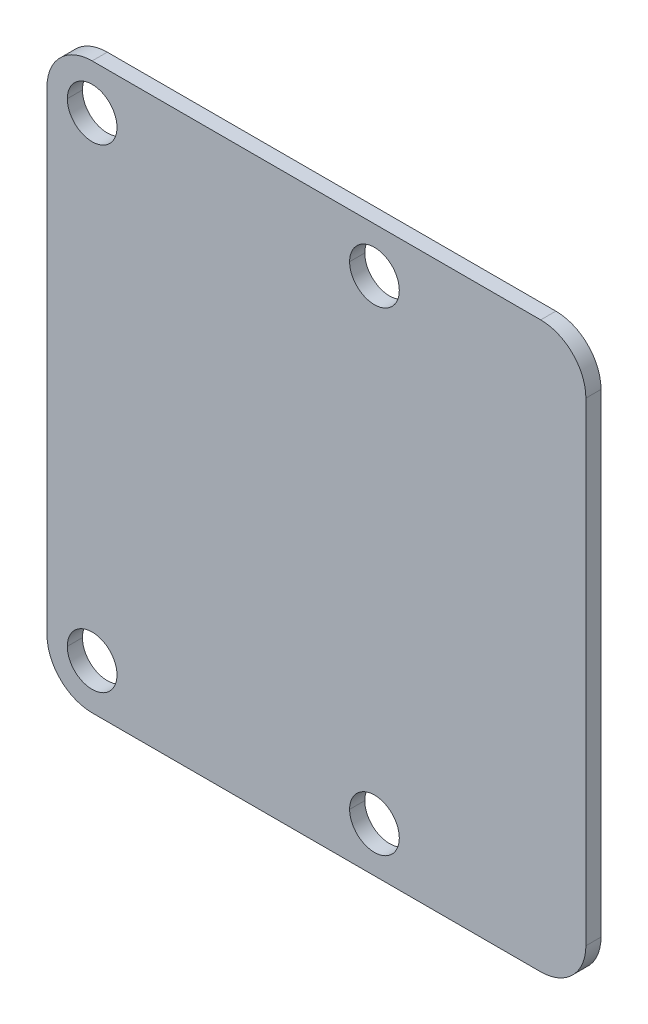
ISO-10303-21;
HEADER;
FILE_DESCRIPTION(('STEP AP214'),'2;1');
FILE_NAME('part.step','',(''),(''),'','','');
FILE_SCHEMA(('AUTOMOTIVE_DESIGN { 1 0 10303 214 1 1 1 1 }'));
ENDSEC;
DATA;
#1=APPLICATION_CONTEXT('core data for automotive mechanical design processes');
#2=APPLICATION_PROTOCOL_DEFINITION('international standard','automotive_design',2000,#1);
#3=PRODUCT_CONTEXT('',#1,'mechanical');
#4=PRODUCT('Part','Part','',(#3));
#5=PRODUCT_RELATED_PRODUCT_CATEGORY('part','',(#4));
#6=PRODUCT_DEFINITION_FORMATION('','',#4);
#7=PRODUCT_DEFINITION_CONTEXT('part definition',#1,'design');
#8=PRODUCT_DEFINITION('design','',#6,#7);
#9=PRODUCT_DEFINITION_SHAPE('','',#8);
#10=(LENGTH_UNIT() NAMED_UNIT(*) SI_UNIT(.MILLI.,.METRE.));
#11=(NAMED_UNIT(*) PLANE_ANGLE_UNIT() SI_UNIT($,.RADIAN.));
#12=(NAMED_UNIT(*) SI_UNIT($,.STERADIAN.) SOLID_ANGLE_UNIT());
#13=UNCERTAINTY_MEASURE_WITH_UNIT(LENGTH_MEASURE(1.E-05),#10,'distance_accuracy_value','');
#14=(GEOMETRIC_REPRESENTATION_CONTEXT(3) GLOBAL_UNCERTAINTY_ASSIGNED_CONTEXT((#13)) GLOBAL_UNIT_ASSIGNED_CONTEXT((#10,
#11,#12)) REPRESENTATION_CONTEXT('',''));
#15=CARTESIAN_POINT('',(0.,0.,0.));
#16=DIRECTION('',(0.,0.,1.));
#17=DIRECTION('',(1.,0.,0.));
#18=AXIS2_PLACEMENT_3D('',#15,#16,#17);
#19=CARTESIAN_POINT('',(2.,25.,-0.70104));
#20=DIRECTION('',(0.,-1.,0.));
#21=DIRECTION('',(0.,0.,-1.));
#22=AXIS2_PLACEMENT_3D('',#19,#20,#21);
#23=PLANE('',#22);
#24=DIRECTION('',(1.,0.,0.));
#25=VECTOR('',#24,1.);
#26=CARTESIAN_POINT('',(11.9309997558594,25.,-0.03048));
#27=LINE('',#26,#25);
#28=CARTESIAN_POINT('',(2.,25.,-0.03048));
#29=VERTEX_POINT('',#28);
#30=CARTESIAN_POINT('',(21.8619995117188,25.,-0.03048));
#31=VERTEX_POINT('',#30);
#32=EDGE_CURVE('E284',#29,#31,#27,.T.);
#33=ORIENTED_EDGE('',*,*,#32,.T.);
#34=DIRECTION('',(0.,0.,-1.));
#35=VECTOR('',#34,1.);
#36=CARTESIAN_POINT('',(21.8619995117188,25.,-0.36576));
#37=LINE('',#36,#35);
#38=CARTESIAN_POINT('',(21.8619995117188,25.,-0.70104));
#39=VERTEX_POINT('',#38);
#40=EDGE_CURVE('E180',#31,#39,#37,.T.);
#41=ORIENTED_EDGE('',*,*,#40,.T.);
#42=DIRECTION('',(1.,0.,0.));
#43=VECTOR('',#42,1.);
#44=CARTESIAN_POINT('',(2.,25.,-0.70104));
#45=LINE('',#44,#43);
#46=CARTESIAN_POINT('',(2.,25.,-0.70104));
#47=VERTEX_POINT('',#46);
#48=EDGE_CURVE('E226',#47,#39,#45,.T.);
#49=ORIENTED_EDGE('',*,*,#48,.F.);
#50=DIRECTION('',(0.,0.,-1.));
#51=VECTOR('',#50,1.);
#52=CARTESIAN_POINT('',(2.,25.,-0.36576));
#53=LINE('',#52,#51);
#54=EDGE_CURVE('E11',#29,#47,#53,.T.);
#55=ORIENTED_EDGE('',*,*,#54,.F.);
#56=EDGE_LOOP('',(#33,#41,#49,#55));
#57=FACE_BOUND('',#56,.T.);
#58=ADVANCED_FACE('F17',(#57),#23,.F.);
#59=CARTESIAN_POINT('',(1.9999994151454,23.0000005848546,-0.70104));
#60=DIRECTION('',(0.,0.,1.));
#61=DIRECTION('',(-0.999999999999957,-2.92427386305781E-07,0.));
#62=AXIS2_PLACEMENT_3D('',#59,#60,#61);
#63=CYLINDRICAL_SURFACE('',#62,1.99999941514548);
#64=CARTESIAN_POINT('',(1.9999994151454,23.0000005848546,-0.03048));
#65=DIRECTION('',(0.,0.,-1.));
#66=DIRECTION('',(-0.999999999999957,-2.92427386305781E-07,0.));
#67=AXIS2_PLACEMENT_3D('',#64,#65,#66);
#68=CIRCLE('',#67,1.99999941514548);
#69=CARTESIAN_POINT('',(0.,23.,-0.03048));
#70=VERTEX_POINT('',#69);
#71=EDGE_CURVE('E288',#70,#29,#68,.T.);
#72=ORIENTED_EDGE('',*,*,#71,.T.);
#73=ORIENTED_EDGE('',*,*,#54,.T.);
#74=CARTESIAN_POINT('',(1.9999994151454,23.0000005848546,-0.70104));
#75=DIRECTION('',(0.,0.,-1.));
#76=DIRECTION('',(-0.999999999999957,-2.92427386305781E-07,0.));
#77=AXIS2_PLACEMENT_3D('',#74,#75,#76);
#78=CIRCLE('',#77,1.99999941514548);
#79=CARTESIAN_POINT('',(0.,23.,-0.70104));
#80=VERTEX_POINT('',#79);
#81=EDGE_CURVE('E251',#80,#47,#78,.T.);
#82=ORIENTED_EDGE('',*,*,#81,.F.);
#83=DIRECTION('',(0.,0.,-1.));
#84=VECTOR('',#83,1.);
#85=CARTESIAN_POINT('',(0.,23.,-0.36576));
#86=LINE('',#85,#84);
#87=EDGE_CURVE('E25',#70,#80,#86,.T.);
#88=ORIENTED_EDGE('',*,*,#87,.F.);
#89=EDGE_LOOP('',(#72,#73,#82,#88));
#90=FACE_BOUND('',#89,.T.);
#91=ADVANCED_FACE('F308',(#90),#63,.T.);
#92=CARTESIAN_POINT('',(0.,2.,-0.70104));
#93=DIRECTION('',(1.,0.,0.));
#94=DIRECTION('',(0.,1.,0.));
#95=AXIS2_PLACEMENT_3D('',#92,#93,#94);
#96=PLANE('',#95);
#97=DIRECTION('',(0.,1.,0.));
#98=VECTOR('',#97,1.);
#99=CARTESIAN_POINT('',(0.,12.5,-0.03048));
#100=LINE('',#99,#98);
#101=CARTESIAN_POINT('',(0.,2.,-0.03048));
#102=VERTEX_POINT('',#101);
#103=EDGE_CURVE('E294',#102,#70,#100,.T.);
#104=ORIENTED_EDGE('',*,*,#103,.T.);
#105=ORIENTED_EDGE('',*,*,#87,.T.);
#106=DIRECTION('',(0.,1.,0.));
#107=VECTOR('',#106,1.);
#108=CARTESIAN_POINT('',(0.,2.,-0.70104));
#109=LINE('',#108,#107);
#110=CARTESIAN_POINT('',(0.,2.,-0.70104));
#111=VERTEX_POINT('',#110);
#112=EDGE_CURVE('E247',#111,#80,#109,.T.);
#113=ORIENTED_EDGE('',*,*,#112,.F.);
#114=DIRECTION('',(0.,0.,-1.));
#115=VECTOR('',#114,1.);
#116=CARTESIAN_POINT('',(0.,2.,-0.36576));
#117=LINE('',#116,#115);
#118=EDGE_CURVE('E46',#102,#111,#117,.T.);
#119=ORIENTED_EDGE('',*,*,#118,.F.);
#120=EDGE_LOOP('',(#104,#105,#113,#119));
#121=FACE_BOUND('',#120,.T.);
#122=ADVANCED_FACE('F306',(#121),#96,.F.);
#123=CARTESIAN_POINT('',(1.99999987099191,1.99999987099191,-0.70104));
#124=DIRECTION('',(0.,0.,1.));
#125=DIRECTION('',(6.45040472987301E-08,-1.,0.));
#126=AXIS2_PLACEMENT_3D('',#123,#124,#125);
#127=CYLINDRICAL_SURFACE('',#126,1.99999987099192);
#128=CARTESIAN_POINT('',(1.99999987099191,1.99999987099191,-0.03048));
#129=DIRECTION('',(0.,0.,-1.));
#130=DIRECTION('',(6.45040472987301E-08,-1.,0.));
#131=AXIS2_PLACEMENT_3D('',#128,#129,#130);
#132=CIRCLE('',#131,1.99999987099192);
#133=CARTESIAN_POINT('',(2.,0.,-0.03048));
#134=VERTEX_POINT('',#133);
#135=EDGE_CURVE('E203',#134,#102,#132,.T.);
#136=ORIENTED_EDGE('',*,*,#135,.T.);
#137=ORIENTED_EDGE('',*,*,#118,.T.);
#138=CARTESIAN_POINT('',(1.99999987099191,1.99999987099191,-0.70104));
#139=DIRECTION('',(0.,0.,-1.));
#140=DIRECTION('',(6.45040472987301E-08,-1.,0.));
#141=AXIS2_PLACEMENT_3D('',#138,#139,#140);
#142=CIRCLE('',#141,1.99999987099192);
#143=CARTESIAN_POINT('',(2.,0.,-0.70104));
#144=VERTEX_POINT('',#143);
#145=EDGE_CURVE('E235',#144,#111,#142,.T.);
#146=ORIENTED_EDGE('',*,*,#145,.F.);
#147=DIRECTION('',(0.,0.,-1.));
#148=VECTOR('',#147,1.);
#149=CARTESIAN_POINT('',(2.,0.,-0.36576));
#150=LINE('',#149,#148);
#151=EDGE_CURVE('E207',#134,#144,#150,.T.);
#152=ORIENTED_EDGE('',*,*,#151,.F.);
#153=EDGE_LOOP('',(#136,#137,#146,#152));
#154=FACE_BOUND('',#153,.T.);
#155=ADVANCED_FACE('F275',(#154),#127,.T.);
#156=CARTESIAN_POINT('',(21.8619995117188,0.,-0.70104));
#157=DIRECTION('',(0.,1.,0.));
#158=DIRECTION('',(1.,0.,0.));
#159=AXIS2_PLACEMENT_3D('',#156,#157,#158);
#160=PLANE('',#159);
#161=DIRECTION('',(-1.,0.,0.));
#162=VECTOR('',#161,1.);
#163=CARTESIAN_POINT('',(11.9309997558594,0.,-0.03048));
#164=LINE('',#163,#162);
#165=CARTESIAN_POINT('',(21.8619995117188,0.,-0.03048));
#166=VERTEX_POINT('',#165);
#167=EDGE_CURVE('E196',#166,#134,#164,.T.);
#168=ORIENTED_EDGE('',*,*,#167,.T.);
#169=ORIENTED_EDGE('',*,*,#151,.T.);
#170=DIRECTION('',(-1.,0.,0.));
#171=VECTOR('',#170,1.);
#172=CARTESIAN_POINT('',(21.8619995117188,0.,-0.70104));
#173=LINE('',#172,#171);
#174=CARTESIAN_POINT('',(21.8619995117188,0.,-0.70104));
#175=VERTEX_POINT('',#174);
#176=EDGE_CURVE('E231',#175,#144,#173,.T.);
#177=ORIENTED_EDGE('',*,*,#176,.F.);
#178=DIRECTION('',(0.,0.,-1.));
#179=VECTOR('',#178,1.);
#180=CARTESIAN_POINT('',(21.8619995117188,0.,-0.36576));
#181=LINE('',#180,#179);
#182=EDGE_CURVE('E179',#166,#175,#181,.T.);
#183=ORIENTED_EDGE('',*,*,#182,.F.);
#184=EDGE_LOOP('',(#168,#169,#177,#183));
#185=FACE_BOUND('',#184,.T.);
#186=ADVANCED_FACE('F274',(#185),#160,.F.);
#187=CARTESIAN_POINT('',(21.8620000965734,1.9999994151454,-0.70104));
#188=DIRECTION('',(0.,0.,1.));
#189=DIRECTION('',(0.999999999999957,2.92427385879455E-07,0.));
#190=AXIS2_PLACEMENT_3D('',#187,#188,#189);
#191=CYLINDRICAL_SURFACE('',#190,1.99999941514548);
#192=CARTESIAN_POINT('',(21.8620000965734,1.9999994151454,-0.03048));
#193=DIRECTION('',(0.,0.,-1.));
#194=DIRECTION('',(0.999999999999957,2.92427385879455E-07,0.));
#195=AXIS2_PLACEMENT_3D('',#192,#193,#194);
#196=CIRCLE('',#195,1.99999941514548);
#197=CARTESIAN_POINT('',(23.8619995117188,2.,-0.03048));
#198=VERTEX_POINT('',#197);
#199=EDGE_CURVE('E171',#198,#166,#196,.T.);
#200=ORIENTED_EDGE('',*,*,#199,.T.);
#201=ORIENTED_EDGE('',*,*,#182,.T.);
#202=CARTESIAN_POINT('',(21.8620000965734,1.9999994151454,-0.70104));
#203=DIRECTION('',(0.,0.,-1.));
#204=DIRECTION('',(0.999999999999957,2.92427385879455E-07,0.));
#205=AXIS2_PLACEMENT_3D('',#202,#203,#204);
#206=CIRCLE('',#205,1.99999941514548);
#207=CARTESIAN_POINT('',(23.8619995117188,2.,-0.70104));
#208=VERTEX_POINT('',#207);
#209=EDGE_CURVE('E174',#208,#175,#206,.T.);
#210=ORIENTED_EDGE('',*,*,#209,.F.);
#211=DIRECTION('',(0.,0.,-1.));
#212=VECTOR('',#211,1.);
#213=CARTESIAN_POINT('',(23.8619995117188,2.,-0.36576));
#214=LINE('',#213,#212);
#215=EDGE_CURVE('E167',#198,#208,#214,.T.);
#216=ORIENTED_EDGE('',*,*,#215,.F.);
#217=EDGE_LOOP('',(#200,#201,#210,#216));
#218=FACE_BOUND('',#217,.T.);
#219=ADVANCED_FACE('F169',(#218),#191,.T.);
#220=CARTESIAN_POINT('',(23.8619995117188,23.,-0.70104));
#221=DIRECTION('',(-1.,0.,0.));
#222=DIRECTION('',(0.,0.,1.));
#223=AXIS2_PLACEMENT_3D('',#220,#221,#222);
#224=PLANE('',#223);
#225=DIRECTION('',(0.,-1.,0.));
#226=VECTOR('',#225,1.);
#227=CARTESIAN_POINT('',(23.8619995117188,12.5,-0.03048));
#228=LINE('',#227,#226);
#229=CARTESIAN_POINT('',(23.8619995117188,23.,-0.03048));
#230=VERTEX_POINT('',#229);
#231=EDGE_CURVE('E183',#230,#198,#228,.T.);
#232=ORIENTED_EDGE('',*,*,#231,.T.);
#233=ORIENTED_EDGE('',*,*,#215,.T.);
#234=DIRECTION('',(0.,-1.,0.));
#235=VECTOR('',#234,1.);
#236=CARTESIAN_POINT('',(23.8619995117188,23.,-0.70104));
#237=LINE('',#236,#235);
#238=CARTESIAN_POINT('',(23.8619995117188,23.,-0.70104));
#239=VERTEX_POINT('',#238);
#240=EDGE_CURVE('E239',#239,#208,#237,.T.);
#241=ORIENTED_EDGE('',*,*,#240,.F.);
#242=DIRECTION('',(0.,0.,-1.));
#243=VECTOR('',#242,1.);
#244=CARTESIAN_POINT('',(23.8619995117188,23.,-0.36576));
#245=LINE('',#244,#243);
#246=EDGE_CURVE('E185',#230,#239,#245,.T.);
#247=ORIENTED_EDGE('',*,*,#246,.F.);
#248=EDGE_LOOP('',(#232,#233,#241,#247));
#249=FACE_BOUND('',#248,.T.);
#250=ADVANCED_FACE('F184',(#249),#224,.F.);
#251=CARTESIAN_POINT('',(21.8620005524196,23.0000010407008,-0.70104));
#252=DIRECTION('',(0.,0.,1.));
#253=DIRECTION('',(-5.20350681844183E-07,0.999999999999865,0.));
#254=AXIS2_PLACEMENT_3D('',#251,#252,#253);
#255=CYLINDRICAL_SURFACE('',#254,1.99999895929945);
#256=CARTESIAN_POINT('',(21.8620005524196,23.0000010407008,-0.03048));
#257=DIRECTION('',(0.,0.,-1.));
#258=DIRECTION('',(-5.20350681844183E-07,0.999999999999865,0.));
#259=AXIS2_PLACEMENT_3D('',#256,#257,#258);
#260=CIRCLE('',#259,1.99999895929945);
#261=EDGE_CURVE('E190',#31,#230,#260,.T.);
#262=ORIENTED_EDGE('',*,*,#261,.T.);
#263=ORIENTED_EDGE('',*,*,#246,.T.);
#264=CARTESIAN_POINT('',(21.8620005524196,23.0000010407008,-0.70104));
#265=DIRECTION('',(0.,0.,-1.));
#266=DIRECTION('',(-5.20350681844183E-07,0.999999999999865,0.));
#267=AXIS2_PLACEMENT_3D('',#264,#265,#266);
#268=CIRCLE('',#267,1.99999895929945);
#269=EDGE_CURVE('E230',#39,#239,#268,.T.);
#270=ORIENTED_EDGE('',*,*,#269,.F.);
#271=ORIENTED_EDGE('',*,*,#40,.F.);
#272=EDGE_LOOP('',(#262,#263,#270,#271));
#273=FACE_BOUND('',#272,.T.);
#274=ADVANCED_FACE('F281',(#273),#255,.T.);
#275=CARTESIAN_POINT('',(1.99999997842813,1.99999996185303,-0.70104));
#276=DIRECTION('',(0.,0.,1.));
#277=DIRECTION('',(-1.,3.46790667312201E-08,0.));
#278=AXIS2_PLACEMENT_3D('',#275,#276,#277);
#279=CYLINDRICAL_SURFACE('',#278,1.09999997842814);
#280=DIRECTION('',(0.,0.,1.));
#281=VECTOR('',#280,1.);
#282=CARTESIAN_POINT('',(0.9,2.,-0.70104));
#283=LINE('',#282,#281);
#284=CARTESIAN_POINT('',(0.9,2.,-0.70104));
#285=VERTEX_POINT('',#284);
#286=CARTESIAN_POINT('',(0.9,2.,-0.03048));
#287=VERTEX_POINT('',#286);
#288=EDGE_CURVE('E392',#285,#287,#283,.T.);
#289=ORIENTED_EDGE('',*,*,#288,.T.);
#290=CARTESIAN_POINT('',(1.99999997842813,1.99999996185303,-0.03048));
#291=DIRECTION('',(0.,0.,1.));
#292=DIRECTION('',(-1.,3.46790667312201E-08,0.));
#293=AXIS2_PLACEMENT_3D('',#290,#291,#292);
#294=CIRCLE('',#293,1.09999997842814);
#295=CARTESIAN_POINT('',(3.09999995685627,1.99999992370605,-0.03048));
#296=VERTEX_POINT('',#295);
#297=EDGE_CURVE('E209',#287,#296,#294,.T.);
#298=ORIENTED_EDGE('',*,*,#297,.T.);
#299=DIRECTION('',(0.,0.,-1.));
#300=VECTOR('',#299,1.);
#301=CARTESIAN_POINT('',(3.09999995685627,1.99999992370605,-0.70104));
#302=LINE('',#301,#300);
#303=CARTESIAN_POINT('',(3.09999995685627,1.99999992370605,-0.70104));
#304=VERTEX_POINT('',#303);
#305=EDGE_CURVE('E391',#296,#304,#302,.T.);
#306=ORIENTED_EDGE('',*,*,#305,.T.);
#307=CARTESIAN_POINT('',(1.99999997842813,1.99999996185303,-0.70104));
#308=DIRECTION('',(0.,0.,1.));
#309=DIRECTION('',(-1.,3.46790667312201E-08,0.));
#310=AXIS2_PLACEMENT_3D('',#307,#308,#309);
#311=CIRCLE('',#310,1.09999997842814);
#312=EDGE_CURVE('E255',#285,#304,#311,.T.);
#313=ORIENTED_EDGE('',*,*,#312,.F.);
#314=EDGE_LOOP('',(#289,#298,#306,#313));
#315=FACE_BOUND('',#314,.T.);
#316=ADVANCED_FACE('F320',(#315),#279,.F.);
#317=CARTESIAN_POINT('',(14.4999999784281,1.99999996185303,-0.70104));
#318=DIRECTION('',(0.,0.,1.));
#319=DIRECTION('',(-1.,3.46790667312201E-08,0.));
#320=AXIS2_PLACEMENT_3D('',#317,#318,#319);
#321=CYLINDRICAL_SURFACE('',#320,1.09999997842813);
#322=DIRECTION('',(0.,0.,1.));
#323=VECTOR('',#322,1.);
#324=CARTESIAN_POINT('',(13.4,2.,-0.70104));
#325=LINE('',#324,#323);
#326=CARTESIAN_POINT('',(13.4,2.,-0.70104));
#327=VERTEX_POINT('',#326);
#328=CARTESIAN_POINT('',(13.4,2.,-0.03048));
#329=VERTEX_POINT('',#328);
#330=EDGE_CURVE('E400',#327,#329,#325,.T.);
#331=ORIENTED_EDGE('',*,*,#330,.T.);
#332=CARTESIAN_POINT('',(14.4999999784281,1.99999996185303,-0.03048));
#333=DIRECTION('',(0.,0.,1.));
#334=DIRECTION('',(-1.,3.46790667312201E-08,0.));
#335=AXIS2_PLACEMENT_3D('',#332,#333,#334);
#336=CIRCLE('',#335,1.09999997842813);
#337=CARTESIAN_POINT('',(15.5999999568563,1.99999992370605,-0.03048));
#338=VERTEX_POINT('',#337);
#339=EDGE_CURVE('E212',#329,#338,#336,.T.);
#340=ORIENTED_EDGE('',*,*,#339,.T.);
#341=DIRECTION('',(0.,0.,-1.));
#342=VECTOR('',#341,1.);
#343=CARTESIAN_POINT('',(15.5999999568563,1.99999992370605,-0.70104));
#344=LINE('',#343,#342);
#345=CARTESIAN_POINT('',(15.5999999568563,1.99999992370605,-0.70104));
#346=VERTEX_POINT('',#345);
#347=EDGE_CURVE('E405',#338,#346,#344,.T.);
#348=ORIENTED_EDGE('',*,*,#347,.T.);
#349=CARTESIAN_POINT('',(14.4999999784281,1.99999996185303,-0.70104));
#350=DIRECTION('',(0.,0.,1.));
#351=DIRECTION('',(-1.,3.46790667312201E-08,0.));
#352=AXIS2_PLACEMENT_3D('',#349,#350,#351);
#353=CIRCLE('',#352,1.09999997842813);
#354=EDGE_CURVE('E217',#327,#346,#353,.T.);
#355=ORIENTED_EDGE('',*,*,#354,.F.);
#356=EDGE_LOOP('',(#331,#340,#348,#355));
#357=FACE_BOUND('',#356,.T.);
#358=ADVANCED_FACE('F323',(#357),#321,.F.);
#359=CARTESIAN_POINT('',(2.00000013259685,22.9999987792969,-0.70104));
#360=DIRECTION('',(0.,0.,1.));
#361=DIRECTION('',(-0.999999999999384,1.10972997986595E-06,0.));
#362=AXIS2_PLACEMENT_3D('',#359,#360,#361);
#363=CYLINDRICAL_SURFACE('',#362,1.10000013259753);
#364=DIRECTION('',(0.,0.,1.));
#365=VECTOR('',#364,1.);
#366=CARTESIAN_POINT('',(0.9,23.,-0.70104));
#367=LINE('',#366,#365);
#368=CARTESIAN_POINT('',(0.9,23.,-0.70104));
#369=VERTEX_POINT('',#368);
#370=CARTESIAN_POINT('',(0.9,23.,-0.03048));
#371=VERTEX_POINT('',#370);
#372=EDGE_CURVE('E416',#369,#371,#367,.T.);
#373=ORIENTED_EDGE('',*,*,#372,.T.);
#374=CARTESIAN_POINT('',(2.00000013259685,22.9999987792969,-0.03048));
#375=DIRECTION('',(0.,0.,1.));
#376=DIRECTION('',(-0.999999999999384,1.10972997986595E-06,0.));
#377=AXIS2_PLACEMENT_3D('',#374,#375,#376);
#378=CIRCLE('',#377,1.10000013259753);
#379=CARTESIAN_POINT('',(3.10000026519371,22.9999975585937,-0.03048));
#380=VERTEX_POINT('',#379);
#381=EDGE_CURVE('E220',#371,#380,#378,.T.);
#382=ORIENTED_EDGE('',*,*,#381,.T.);
#383=DIRECTION('',(0.,0.,-1.));
#384=VECTOR('',#383,1.);
#385=CARTESIAN_POINT('',(3.10000026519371,22.9999975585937,-0.70104));
#386=LINE('',#385,#384);
#387=CARTESIAN_POINT('',(3.10000026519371,22.9999975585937,-0.70104));
#388=VERTEX_POINT('',#387);
#389=EDGE_CURVE('E384',#380,#388,#386,.T.);
#390=ORIENTED_EDGE('',*,*,#389,.T.);
#391=CARTESIAN_POINT('',(2.00000013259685,22.9999987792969,-0.70104));
#392=DIRECTION('',(0.,0.,1.));
#393=DIRECTION('',(-0.999999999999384,1.10972997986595E-06,0.));
#394=AXIS2_PLACEMENT_3D('',#391,#392,#393);
#395=CIRCLE('',#394,1.10000013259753);
#396=EDGE_CURVE('E213',#369,#388,#395,.T.);
#397=ORIENTED_EDGE('',*,*,#396,.F.);
#398=EDGE_LOOP('',(#373,#382,#390,#397));
#399=FACE_BOUND('',#398,.T.);
#400=ADVANCED_FACE('F327',(#399),#363,.F.);
#401=CARTESIAN_POINT('',(14.5000001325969,22.9999987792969,-0.70104));
#402=DIRECTION('',(0.,0.,1.));
#403=DIRECTION('',(-0.999999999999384,1.10972997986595E-06,0.));
#404=AXIS2_PLACEMENT_3D('',#401,#402,#403);
#405=CYLINDRICAL_SURFACE('',#404,1.10000013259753);
#406=DIRECTION('',(0.,0.,1.));
#407=VECTOR('',#406,1.);
#408=CARTESIAN_POINT('',(13.4,23.,-0.70104));
#409=LINE('',#408,#407);
#410=CARTESIAN_POINT('',(13.4,23.,-0.70104));
#411=VERTEX_POINT('',#410);
#412=CARTESIAN_POINT('',(13.4,23.,-0.03048));
#413=VERTEX_POINT('',#412);
#414=EDGE_CURVE('E369',#411,#413,#409,.T.);
#415=ORIENTED_EDGE('',*,*,#414,.T.);
#416=CARTESIAN_POINT('',(14.5000001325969,22.9999987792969,-0.03048));
#417=DIRECTION('',(0.,0.,1.));
#418=DIRECTION('',(-0.999999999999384,1.10972997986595E-06,0.));
#419=AXIS2_PLACEMENT_3D('',#416,#417,#418);
#420=CIRCLE('',#419,1.10000013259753);
#421=CARTESIAN_POINT('',(15.6000002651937,22.9999975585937,-0.03048));
#422=VERTEX_POINT('',#421);
#423=EDGE_CURVE('E223',#413,#422,#420,.T.);
#424=ORIENTED_EDGE('',*,*,#423,.T.);
#425=DIRECTION('',(0.,0.,-1.));
#426=VECTOR('',#425,1.);
#427=CARTESIAN_POINT('',(15.6000002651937,22.9999975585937,-0.70104));
#428=LINE('',#427,#426);
#429=CARTESIAN_POINT('',(15.6000002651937,22.9999975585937,-0.70104));
#430=VERTEX_POINT('',#429);
#431=EDGE_CURVE('E297',#422,#430,#428,.T.);
#432=ORIENTED_EDGE('',*,*,#431,.T.);
#433=CARTESIAN_POINT('',(14.5000001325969,22.9999987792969,-0.70104));
#434=DIRECTION('',(0.,0.,1.));
#435=DIRECTION('',(-0.999999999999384,1.10972997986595E-06,0.));
#436=AXIS2_PLACEMENT_3D('',#433,#434,#435);
#437=CIRCLE('',#436,1.10000013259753);
#438=EDGE_CURVE('E216',#411,#430,#437,.T.);
#439=ORIENTED_EDGE('',*,*,#438,.F.);
#440=EDGE_LOOP('',(#415,#424,#432,#439));
#441=FACE_BOUND('',#440,.T.);
#442=ADVANCED_FACE('F333',(#441),#405,.F.);
#443=CARTESIAN_POINT('',(11.9309998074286,12.5000000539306,-0.70104));
#444=DIRECTION('',(0.,0.,1.));
#445=DIRECTION('',(1.,0.,0.));
#446=AXIS2_PLACEMENT_3D('',#443,#444,#445);
#447=PLANE('',#446);
#448=ORIENTED_EDGE('',*,*,#438,.T.);
#449=CARTESIAN_POINT('',(14.5000001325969,22.9999987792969,-0.70104));
#450=DIRECTION('',(0.,0.,1.));
#451=DIRECTION('',(-0.999999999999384,1.10972997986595E-06,0.));
#452=AXIS2_PLACEMENT_3D('',#449,#450,#451);
#453=CIRCLE('',#452,1.10000013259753);
#454=EDGE_CURVE('E375',#430,#411,#453,.T.);
#455=ORIENTED_EDGE('',*,*,#454,.T.);
#456=EDGE_LOOP('',(#448,#455));
#457=FACE_BOUND('',#456,.T.);
#458=ORIENTED_EDGE('',*,*,#396,.T.);
#459=CARTESIAN_POINT('',(2.00000013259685,22.9999987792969,-0.70104));
#460=DIRECTION('',(0.,0.,1.));
#461=DIRECTION('',(-0.999999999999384,1.10972997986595E-06,0.));
#462=AXIS2_PLACEMENT_3D('',#459,#460,#461);
#463=CIRCLE('',#462,1.10000013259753);
#464=EDGE_CURVE('E419',#388,#369,#463,.T.);
#465=ORIENTED_EDGE('',*,*,#464,.T.);
#466=EDGE_LOOP('',(#458,#465));
#467=FACE_BOUND('',#466,.T.);
#468=ORIENTED_EDGE('',*,*,#354,.T.);
#469=CARTESIAN_POINT('',(14.4999999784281,1.99999996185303,-0.70104));
#470=DIRECTION('',(0.,0.,1.));
#471=DIRECTION('',(-1.,3.46790667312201E-08,0.));
#472=AXIS2_PLACEMENT_3D('',#469,#470,#471);
#473=CIRCLE('',#472,1.09999997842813);
#474=EDGE_CURVE('E401',#346,#327,#473,.T.);
#475=ORIENTED_EDGE('',*,*,#474,.T.);
#476=EDGE_LOOP('',(#468,#475));
#477=FACE_BOUND('',#476,.T.);
#478=ORIENTED_EDGE('',*,*,#312,.T.);
#479=CARTESIAN_POINT('',(1.99999997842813,1.99999996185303,-0.70104));
#480=DIRECTION('',(0.,0.,1.));
#481=DIRECTION('',(-1.,3.46790667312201E-08,0.));
#482=AXIS2_PLACEMENT_3D('',#479,#480,#481);
#483=CIRCLE('',#482,1.09999997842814);
#484=EDGE_CURVE('E388',#304,#285,#483,.T.);
#485=ORIENTED_EDGE('',*,*,#484,.T.);
#486=EDGE_LOOP('',(#478,#485));
#487=FACE_BOUND('',#486,.T.);
#488=ORIENTED_EDGE('',*,*,#48,.T.);
#489=ORIENTED_EDGE('',*,*,#269,.T.);
#490=ORIENTED_EDGE('',*,*,#240,.T.);
#491=ORIENTED_EDGE('',*,*,#209,.T.);
#492=ORIENTED_EDGE('',*,*,#176,.T.);
#493=ORIENTED_EDGE('',*,*,#145,.T.);
#494=ORIENTED_EDGE('',*,*,#112,.T.);
#495=ORIENTED_EDGE('',*,*,#81,.T.);
#496=EDGE_LOOP('',(#488,#489,#490,#491,#492,#493,#494,#495));
#497=FACE_BOUND('',#496,.T.);
#498=ADVANCED_FACE('F277',(#457,#467,#477,#487,#497),#447,.F.);
#499=CARTESIAN_POINT('',(11.9309998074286,12.5000000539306,-0.03048));
#500=DIRECTION('',(0.,0.,1.));
#501=DIRECTION('',(1.,0.,0.));
#502=AXIS2_PLACEMENT_3D('',#499,#500,#501);
#503=PLANE('',#502);
#504=ORIENTED_EDGE('',*,*,#423,.F.);
#505=CARTESIAN_POINT('',(14.5000001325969,22.9999987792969,-0.03048));
#506=DIRECTION('',(0.,0.,1.));
#507=DIRECTION('',(-0.999999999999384,1.10972997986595E-06,0.));
#508=AXIS2_PLACEMENT_3D('',#505,#506,#507);
#509=CIRCLE('',#508,1.10000013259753);
#510=EDGE_CURVE('E289',#422,#413,#509,.T.);
#511=ORIENTED_EDGE('',*,*,#510,.F.);
#512=EDGE_LOOP('',(#504,#511));
#513=FACE_BOUND('',#512,.T.);
#514=ORIENTED_EDGE('',*,*,#381,.F.);
#515=CARTESIAN_POINT('',(2.00000013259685,22.9999987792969,-0.03048));
#516=DIRECTION('',(0.,0.,1.));
#517=DIRECTION('',(-0.999999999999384,1.10972997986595E-06,0.));
#518=AXIS2_PLACEMENT_3D('',#515,#516,#517);
#519=CIRCLE('',#518,1.10000013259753);
#520=EDGE_CURVE('E376',#380,#371,#519,.T.);
#521=ORIENTED_EDGE('',*,*,#520,.F.);
#522=EDGE_LOOP('',(#514,#521));
#523=FACE_BOUND('',#522,.T.);
#524=ORIENTED_EDGE('',*,*,#339,.F.);
#525=CARTESIAN_POINT('',(14.4999999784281,1.99999996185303,-0.03048));
#526=DIRECTION('',(0.,0.,1.));
#527=DIRECTION('',(-1.,3.46790667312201E-08,0.));
#528=AXIS2_PLACEMENT_3D('',#525,#526,#527);
#529=CIRCLE('',#528,1.09999997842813);
#530=EDGE_CURVE('E412',#338,#329,#529,.T.);
#531=ORIENTED_EDGE('',*,*,#530,.F.);
#532=EDGE_LOOP('',(#524,#531));
#533=FACE_BOUND('',#532,.T.);
#534=ORIENTED_EDGE('',*,*,#297,.F.);
#535=CARTESIAN_POINT('',(1.99999997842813,1.99999996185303,-0.03048));
#536=DIRECTION('',(0.,0.,1.));
#537=DIRECTION('',(-1.,3.46790667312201E-08,0.));
#538=AXIS2_PLACEMENT_3D('',#535,#536,#537);
#539=CIRCLE('',#538,1.09999997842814);
#540=EDGE_CURVE('E396',#296,#287,#539,.T.);
#541=ORIENTED_EDGE('',*,*,#540,.F.);
#542=EDGE_LOOP('',(#534,#541));
#543=FACE_BOUND('',#542,.T.);
#544=ORIENTED_EDGE('',*,*,#32,.F.);
#545=ORIENTED_EDGE('',*,*,#71,.F.);
#546=ORIENTED_EDGE('',*,*,#103,.F.);
#547=ORIENTED_EDGE('',*,*,#135,.F.);
#548=ORIENTED_EDGE('',*,*,#167,.F.);
#549=ORIENTED_EDGE('',*,*,#199,.F.);
#550=ORIENTED_EDGE('',*,*,#231,.F.);
#551=ORIENTED_EDGE('',*,*,#261,.F.);
#552=EDGE_LOOP('',(#544,#545,#546,#547,#548,#549,#550,#551));
#553=FACE_BOUND('',#552,.T.);
#554=ADVANCED_FACE('F193',(#513,#523,#533,#543,#553),#503,.T.);
#555=CARTESIAN_POINT('',(14.5000001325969,22.9999987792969,-0.70104));
#556=DIRECTION('',(0.,0.,1.));
#557=DIRECTION('',(-0.999999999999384,1.10972997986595E-06,0.));
#558=AXIS2_PLACEMENT_3D('',#555,#556,#557);
#559=CYLINDRICAL_SURFACE('',#558,1.10000013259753);
#560=ORIENTED_EDGE('',*,*,#414,.F.);
#561=ORIENTED_EDGE('',*,*,#454,.F.);
#562=ORIENTED_EDGE('',*,*,#431,.F.);
#563=ORIENTED_EDGE('',*,*,#510,.T.);
#564=EDGE_LOOP('',(#560,#561,#562,#563));
#565=FACE_BOUND('',#564,.T.);
#566=ADVANCED_FACE('F344',(#565),#559,.F.);
#567=CARTESIAN_POINT('',(2.00000013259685,22.9999987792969,-0.70104));
#568=DIRECTION('',(0.,0.,1.));
#569=DIRECTION('',(-0.999999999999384,1.10972997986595E-06,0.));
#570=AXIS2_PLACEMENT_3D('',#567,#568,#569);
#571=CYLINDRICAL_SURFACE('',#570,1.10000013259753);
#572=ORIENTED_EDGE('',*,*,#372,.F.);
#573=ORIENTED_EDGE('',*,*,#464,.F.);
#574=ORIENTED_EDGE('',*,*,#389,.F.);
#575=ORIENTED_EDGE('',*,*,#520,.T.);
#576=EDGE_LOOP('',(#572,#573,#574,#575));
#577=FACE_BOUND('',#576,.T.);
#578=ADVANCED_FACE('F348',(#577),#571,.F.);
#579=CARTESIAN_POINT('',(14.4999999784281,1.99999996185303,-0.70104));
#580=DIRECTION('',(0.,0.,1.));
#581=DIRECTION('',(-1.,3.46790667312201E-08,0.));
#582=AXIS2_PLACEMENT_3D('',#579,#580,#581);
#583=CYLINDRICAL_SURFACE('',#582,1.09999997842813);
#584=ORIENTED_EDGE('',*,*,#330,.F.);
#585=ORIENTED_EDGE('',*,*,#474,.F.);
#586=ORIENTED_EDGE('',*,*,#347,.F.);
#587=ORIENTED_EDGE('',*,*,#530,.T.);
#588=EDGE_LOOP('',(#584,#585,#586,#587));
#589=FACE_BOUND('',#588,.T.);
#590=ADVANCED_FACE('F352',(#589),#583,.F.);
#591=CARTESIAN_POINT('',(1.99999997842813,1.99999996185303,-0.70104));
#592=DIRECTION('',(0.,0.,1.));
#593=DIRECTION('',(-1.,3.46790667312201E-08,0.));
#594=AXIS2_PLACEMENT_3D('',#591,#592,#593);
#595=CYLINDRICAL_SURFACE('',#594,1.09999997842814);
#596=ORIENTED_EDGE('',*,*,#288,.F.);
#597=ORIENTED_EDGE('',*,*,#484,.F.);
#598=ORIENTED_EDGE('',*,*,#305,.F.);
#599=ORIENTED_EDGE('',*,*,#540,.T.);
#600=EDGE_LOOP('',(#596,#597,#598,#599));
#601=FACE_BOUND('',#600,.T.);
#602=ADVANCED_FACE('F356',(#601),#595,.F.);
#603=CLOSED_SHELL('',(#58,#91,#122,#155,#186,#219,#250,#274,#316,#358,#400,#442,#498,#554,#566,
#578,#590,#602));
#604=MANIFOLD_SOLID_BREP('B1',#603);
#605=ADVANCED_BREP_SHAPE_REPRESENTATION('',(#18,#604),#14);
#606=SHAPE_DEFINITION_REPRESENTATION(#9,#605);
ENDSEC;
END-ISO-10303-21;
